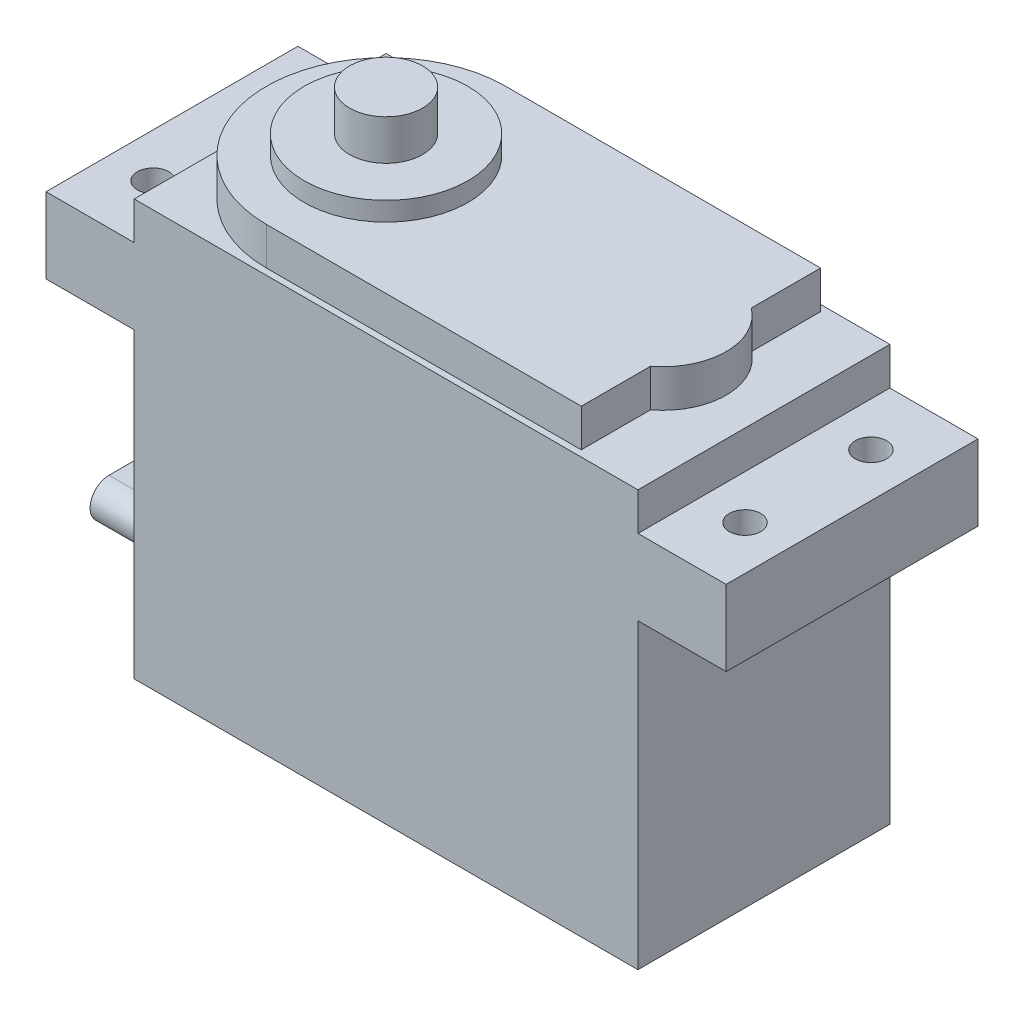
ISO-10303-21;
HEADER;
FILE_DESCRIPTION(('STEP AP214'),'2;1');
FILE_NAME('part.step','',(''),(''),'','','');
FILE_SCHEMA(('AUTOMOTIVE_DESIGN { 1 0 10303 214 1 1 1 1 }'));
ENDSEC;
DATA;
#1=APPLICATION_CONTEXT('core data for automotive mechanical design processes');
#2=APPLICATION_PROTOCOL_DEFINITION('international standard','automotive_design',2000,#1);
#3=PRODUCT_CONTEXT('',#1,'mechanical');
#4=PRODUCT('Part','Part','',(#3));
#5=PRODUCT_RELATED_PRODUCT_CATEGORY('part','',(#4));
#6=PRODUCT_DEFINITION_FORMATION('','',#4);
#7=PRODUCT_DEFINITION_CONTEXT('part definition',#1,'design');
#8=PRODUCT_DEFINITION('design','',#6,#7);
#9=PRODUCT_DEFINITION_SHAPE('','',#8);
#10=(LENGTH_UNIT() NAMED_UNIT(*) SI_UNIT(.MILLI.,.METRE.));
#11=(NAMED_UNIT(*) PLANE_ANGLE_UNIT() SI_UNIT($,.RADIAN.));
#12=(NAMED_UNIT(*) SI_UNIT($,.STERADIAN.) SOLID_ANGLE_UNIT());
#13=UNCERTAINTY_MEASURE_WITH_UNIT(LENGTH_MEASURE(1.E-05),#10,'distance_accuracy_value','');
#14=(GEOMETRIC_REPRESENTATION_CONTEXT(3) GLOBAL_UNCERTAINTY_ASSIGNED_CONTEXT((#13)) GLOBAL_UNIT_ASSIGNED_CONTEXT((#10,
#11,#12)) REPRESENTATION_CONTEXT('',''));
#15=CARTESIAN_POINT('',(0.,0.,0.));
#16=DIRECTION('',(0.,0.,1.));
#17=DIRECTION('',(1.,0.,0.));
#18=AXIS2_PLACEMENT_3D('',#15,#16,#17);
#19=CARTESIAN_POINT('',(-0.5,3.,8.50000000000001));
#20=DIRECTION('',(-1.,0.,0.));
#21=DIRECTION('',(0.,0.,1.));
#22=AXIS2_PLACEMENT_3D('',#19,#20,#21);
#23=PLANE('',#22);
#24=CARTESIAN_POINT('',(-0.5,3.,8.50000000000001));
#25=DIRECTION('',(-1.,0.,0.));
#26=DIRECTION('',(0.,0.,1.));
#27=AXIS2_PLACEMENT_3D('',#24,#25,#26);
#28=CIRCLE('',#27,2.);
#29=CARTESIAN_POINT('',(-0.5,5.,8.50000000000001));
#30=VERTEX_POINT('',#29);
#31=CARTESIAN_POINT('',(-0.5,1.,8.50000000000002));
#32=VERTEX_POINT('',#31);
#33=EDGE_CURVE('E239',#30,#32,#28,.T.);
#34=ORIENTED_EDGE('',*,*,#33,.T.);
#35=DIRECTION('',(0.,0.,1.));
#36=VECTOR('',#35,1.);
#37=CARTESIAN_POINT('',(-0.5,1.,11.5));
#38=LINE('',#37,#36);
#39=CARTESIAN_POINT('',(-0.5,1.,11.5));
#40=VERTEX_POINT('',#39);
#41=EDGE_CURVE('E242',#32,#40,#38,.T.);
#42=ORIENTED_EDGE('',*,*,#41,.T.);
#43=CARTESIAN_POINT('',(-0.5,3.,11.5));
#44=DIRECTION('',(-1.,0.,0.));
#45=DIRECTION('',(0.,0.,-1.));
#46=AXIS2_PLACEMENT_3D('',#43,#44,#45);
#47=CIRCLE('',#46,2.);
#48=CARTESIAN_POINT('',(-0.5,5.,11.5));
#49=VERTEX_POINT('',#48);
#50=EDGE_CURVE('E245',#40,#49,#47,.T.);
#51=ORIENTED_EDGE('',*,*,#50,.T.);
#52=DIRECTION('',(0.,0.,-1.));
#53=VECTOR('',#52,1.);
#54=CARTESIAN_POINT('',(-0.5,5.,8.50000000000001));
#55=LINE('',#54,#53);
#56=EDGE_CURVE('E247',#49,#30,#55,.T.);
#57=ORIENTED_EDGE('',*,*,#56,.T.);
#58=EDGE_LOOP('',(#34,#42,#51,#57));
#59=FACE_BOUND('',#58,.T.);
#60=DIRECTION('',(0.,0.,1.));
#61=VECTOR('',#60,1.);
#62=CARTESIAN_POINT('',(-0.5,1.5,8.50000000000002));
#63=LINE('',#62,#61);
#64=CARTESIAN_POINT('',(-0.5,1.5,8.50000000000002));
#65=VERTEX_POINT('',#64);
#66=CARTESIAN_POINT('',(-0.5,1.5,11.5));
#67=VERTEX_POINT('',#66);
#68=EDGE_CURVE('E852',#65,#67,#63,.T.);
#69=ORIENTED_EDGE('',*,*,#68,.F.);
#70=CARTESIAN_POINT('',(-0.5,3.,8.50000000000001));
#71=DIRECTION('',(-1.,0.,0.));
#72=DIRECTION('',(0.,0.,1.));
#73=AXIS2_PLACEMENT_3D('',#70,#71,#72);
#74=CIRCLE('',#73,1.5);
#75=CARTESIAN_POINT('',(-0.5,4.5,8.50000000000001));
#76=VERTEX_POINT('',#75);
#77=EDGE_CURVE('E230',#76,#65,#74,.T.);
#78=ORIENTED_EDGE('',*,*,#77,.F.);
#79=DIRECTION('',(0.,0.,-1.));
#80=VECTOR('',#79,1.);
#81=CARTESIAN_POINT('',(-0.5,4.5,11.5));
#82=LINE('',#81,#80);
#83=CARTESIAN_POINT('',(-0.5,4.5,11.5));
#84=VERTEX_POINT('',#83);
#85=EDGE_CURVE('E226',#84,#76,#82,.T.);
#86=ORIENTED_EDGE('',*,*,#85,.F.);
#87=CARTESIAN_POINT('',(-0.5,3.,11.5));
#88=DIRECTION('',(-1.,0.,0.));
#89=DIRECTION('',(0.,0.,1.));
#90=AXIS2_PLACEMENT_3D('',#87,#88,#89);
#91=CIRCLE('',#90,1.5);
#92=EDGE_CURVE('E849',#67,#84,#91,.T.);
#93=ORIENTED_EDGE('',*,*,#92,.F.);
#94=EDGE_LOOP('',(#69,#78,#86,#93));
#95=FACE_BOUND('',#94,.T.);
#96=ADVANCED_FACE('F34',(#59,#95),#23,.T.);
#97=CARTESIAN_POINT('',(0.,0.,20.));
#98=DIRECTION('',(1.,0.,0.));
#99=DIRECTION('',(0.,0.,-1.));
#100=AXIS2_PLACEMENT_3D('',#97,#98,#99);
#101=PLANE('',#100);
#102=DIRECTION('',(0.,-1.,0.));
#103=VECTOR('',#102,1.);
#104=CARTESIAN_POINT('',(0.,0.,0.));
#105=LINE('',#104,#103);
#106=CARTESIAN_POINT('',(0.,24.,0.));
#107=VERTEX_POINT('',#106);
#108=CARTESIAN_POINT('',(0.,0.,0.));
#109=VERTEX_POINT('',#108);
#110=EDGE_CURVE('E371',#107,#109,#105,.T.);
#111=ORIENTED_EDGE('',*,*,#110,.T.);
#112=DIRECTION('',(0.,0.,-1.));
#113=VECTOR('',#112,1.);
#114=CARTESIAN_POINT('',(0.,0.,20.));
#115=LINE('',#114,#113);
#116=CARTESIAN_POINT('',(0.,0.,20.));
#117=VERTEX_POINT('',#116);
#118=EDGE_CURVE('E42',#117,#109,#115,.T.);
#119=ORIENTED_EDGE('',*,*,#118,.F.);
#120=DIRECTION('',(0.,-1.,0.));
#121=VECTOR('',#120,1.);
#122=CARTESIAN_POINT('',(0.,0.,20.));
#123=LINE('',#122,#121);
#124=CARTESIAN_POINT('',(0.,24.,20.));
#125=VERTEX_POINT('',#124);
#126=EDGE_CURVE('E344',#125,#117,#123,.T.);
#127=ORIENTED_EDGE('',*,*,#126,.F.);
#128=DIRECTION('',(0.,0.,-1.));
#129=VECTOR('',#128,1.);
#130=CARTESIAN_POINT('',(0.,24.,20.));
#131=LINE('',#130,#129);
#132=EDGE_CURVE('E370',#125,#107,#131,.T.);
#133=ORIENTED_EDGE('',*,*,#132,.T.);
#134=EDGE_LOOP('',(#111,#119,#127,#133));
#135=FACE_BOUND('',#134,.T.);
#136=CARTESIAN_POINT('',(0.,3.,8.50000000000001));
#137=DIRECTION('',(-1.,0.,0.));
#138=DIRECTION('',(0.,0.,1.));
#139=AXIS2_PLACEMENT_3D('',#136,#137,#138);
#140=CIRCLE('',#139,2.);
#141=CARTESIAN_POINT('',(0.,5.,8.50000000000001));
#142=VERTEX_POINT('',#141);
#143=CARTESIAN_POINT('',(0.,1.,8.50000000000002));
#144=VERTEX_POINT('',#143);
#145=EDGE_CURVE('E232',#142,#144,#140,.T.);
#146=ORIENTED_EDGE('',*,*,#145,.F.);
#147=DIRECTION('',(0.,0.,-1.));
#148=VECTOR('',#147,1.);
#149=CARTESIAN_POINT('',(0.,5.,8.50000000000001));
#150=LINE('',#149,#148);
#151=CARTESIAN_POINT('',(0.,5.,11.5));
#152=VERTEX_POINT('',#151);
#153=EDGE_CURVE('E243',#152,#142,#150,.T.);
#154=ORIENTED_EDGE('',*,*,#153,.F.);
#155=CARTESIAN_POINT('',(0.,3.,11.5));
#156=DIRECTION('',(-1.,0.,0.));
#157=DIRECTION('',(0.,0.,-1.));
#158=AXIS2_PLACEMENT_3D('',#155,#156,#157);
#159=CIRCLE('',#158,2.);
#160=CARTESIAN_POINT('',(0.,1.,11.5));
#161=VERTEX_POINT('',#160);
#162=EDGE_CURVE('E251',#161,#152,#159,.T.);
#163=ORIENTED_EDGE('',*,*,#162,.F.);
#164=DIRECTION('',(0.,0.,1.));
#165=VECTOR('',#164,1.);
#166=CARTESIAN_POINT('',(0.,1.,11.5));
#167=LINE('',#166,#165);
#168=EDGE_CURVE('E57',#144,#161,#167,.T.);
#169=ORIENTED_EDGE('',*,*,#168,.F.);
#170=EDGE_LOOP('',(#146,#154,#163,#169));
#171=FACE_BOUND('',#170,.T.);
#172=ADVANCED_FACE('F36',(#135,#171),#101,.F.);
#173=CARTESIAN_POINT('',(10.,37.5,10.));
#174=DIRECTION('',(0.,1.,0.));
#175=DIRECTION('',(0.,0.,1.));
#176=AXIS2_PLACEMENT_3D('',#173,#174,#175);
#177=PLANE('',#176);
#178=CARTESIAN_POINT('',(10.,37.5,10.));
#179=DIRECTION('',(0.,1.,0.));
#180=DIRECTION('',(0.,0.,1.));
#181=AXIS2_PLACEMENT_3D('',#178,#179,#180);
#182=CIRCLE('',#181,6.5);
#183=CARTESIAN_POINT('',(10.,37.5,16.5));
#184=VERTEX_POINT('',#183);
#185=EDGE_CURVE('E270',#184,#184,#182,.T.);
#186=ORIENTED_EDGE('',*,*,#185,.T.);
#187=EDGE_LOOP('',(#186));
#188=FACE_BOUND('',#187,.T.);
#189=CARTESIAN_POINT('',(10.,37.5,10.));
#190=DIRECTION('',(0.,1.,0.));
#191=DIRECTION('',(0.,0.,1.));
#192=AXIS2_PLACEMENT_3D('',#189,#190,#191);
#193=CIRCLE('',#192,2.9);
#194=CARTESIAN_POINT('',(10.,37.5,12.9));
#195=VERTEX_POINT('',#194);
#196=EDGE_CURVE('E266',#195,#195,#193,.T.);
#197=ORIENTED_EDGE('',*,*,#196,.F.);
#198=EDGE_LOOP('',(#197));
#199=FACE_BOUND('',#198,.T.);
#200=ADVANCED_FACE('F458',(#188,#199),#177,.T.);
#201=CARTESIAN_POINT('',(32.,36.,10.));
#202=DIRECTION('',(0.,-1.,0.));
#203=DIRECTION('',(0.,0.,-1.));
#204=AXIS2_PLACEMENT_3D('',#201,#202,#203);
#205=PLANE('',#204);
#206=DIRECTION('',(0.,0.,-1.));
#207=VECTOR('',#206,1.);
#208=CARTESIAN_POINT('',(35.,36.,0.5));
#209=LINE('',#208,#207);
#210=CARTESIAN_POINT('',(35.,36.,6.));
#211=VERTEX_POINT('',#210);
#212=CARTESIAN_POINT('',(35.,36.,0.5));
#213=VERTEX_POINT('',#212);
#214=EDGE_CURVE('E276',#211,#213,#209,.T.);
#215=ORIENTED_EDGE('',*,*,#214,.T.);
#216=DIRECTION('',(-1.,0.,0.));
#217=VECTOR('',#216,1.);
#218=CARTESIAN_POINT('',(10.,36.,0.5));
#219=LINE('',#218,#217);
#220=CARTESIAN_POINT('',(10.,36.,0.5));
#221=VERTEX_POINT('',#220);
#222=EDGE_CURVE('E279',#213,#221,#219,.T.);
#223=ORIENTED_EDGE('',*,*,#222,.T.);
#224=CARTESIAN_POINT('',(10.,36.,10.));
#225=DIRECTION('',(0.,1.,0.));
#226=DIRECTION('',(0.,0.,1.));
#227=AXIS2_PLACEMENT_3D('',#224,#225,#226);
#228=CIRCLE('',#227,9.5);
#229=CARTESIAN_POINT('',(10.,36.,19.5));
#230=VERTEX_POINT('',#229);
#231=EDGE_CURVE('E282',#221,#230,#228,.T.);
#232=ORIENTED_EDGE('',*,*,#231,.T.);
#233=DIRECTION('',(1.,0.,0.));
#234=VECTOR('',#233,1.);
#235=CARTESIAN_POINT('',(35.,36.,19.5));
#236=LINE('',#235,#234);
#237=CARTESIAN_POINT('',(35.,36.,19.5));
#238=VERTEX_POINT('',#237);
#239=EDGE_CURVE('E284',#230,#238,#236,.T.);
#240=ORIENTED_EDGE('',*,*,#239,.T.);
#241=DIRECTION('',(0.,0.,-1.));
#242=VECTOR('',#241,1.);
#243=CARTESIAN_POINT('',(35.,36.,14.));
#244=LINE('',#243,#242);
#245=CARTESIAN_POINT('',(35.,36.,14.));
#246=VERTEX_POINT('',#245);
#247=EDGE_CURVE('E286',#238,#246,#244,.T.);
#248=ORIENTED_EDGE('',*,*,#247,.T.);
#249=CARTESIAN_POINT('',(32.,36.,10.));
#250=DIRECTION('',(0.,1.,0.));
#251=DIRECTION('',(0.,0.,-1.));
#252=AXIS2_PLACEMENT_3D('',#249,#250,#251);
#253=CIRCLE('',#252,5.);
#254=EDGE_CURVE('E288',#246,#211,#253,.T.);
#255=ORIENTED_EDGE('',*,*,#254,.T.);
#256=EDGE_LOOP('',(#215,#223,#232,#240,#248,#255));
#257=FACE_BOUND('',#256,.T.);
#258=CARTESIAN_POINT('',(10.,36.,10.));
#259=DIRECTION('',(0.,-1.,0.));
#260=DIRECTION('',(0.,0.,-1.));
#261=AXIS2_PLACEMENT_3D('',#258,#259,#260);
#262=CIRCLE('',#261,6.5);
#263=CARTESIAN_POINT('',(10.,36.,3.5));
#264=VERTEX_POINT('',#263);
#265=EDGE_CURVE('E11',#264,#264,#262,.F.);
#266=ORIENTED_EDGE('',*,*,#265,.F.);
#267=EDGE_LOOP('',(#266));
#268=FACE_BOUND('',#267,.T.);
#269=ADVANCED_FACE('F491',(#257,#268),#205,.F.);
#270=CARTESIAN_POINT('',(0.,33.,20.));
#271=DIRECTION('',(0.,-1.,0.));
#272=DIRECTION('',(0.,0.,-1.));
#273=AXIS2_PLACEMENT_3D('',#270,#271,#272);
#274=PLANE('',#273);
#275=DIRECTION('',(-1.,0.,0.));
#276=VECTOR('',#275,1.);
#277=CARTESIAN_POINT('',(0.,33.,0.));
#278=LINE('',#277,#276);
#279=CARTESIAN_POINT('',(40.,33.,0.));
#280=VERTEX_POINT('',#279);
#281=CARTESIAN_POINT('',(0.,33.,0.));
#282=VERTEX_POINT('',#281);
#283=EDGE_CURVE('E386',#280,#282,#278,.T.);
#284=ORIENTED_EDGE('',*,*,#283,.T.);
#285=DIRECTION('',(0.,0.,-1.));
#286=VECTOR('',#285,1.);
#287=CARTESIAN_POINT('',(0.,33.,20.));
#288=LINE('',#287,#286);
#289=CARTESIAN_POINT('',(0.,33.,20.));
#290=VERTEX_POINT('',#289);
#291=EDGE_CURVE('E406',#290,#282,#288,.T.);
#292=ORIENTED_EDGE('',*,*,#291,.F.);
#293=DIRECTION('',(-1.,0.,0.));
#294=VECTOR('',#293,1.);
#295=CARTESIAN_POINT('',(0.,33.,20.));
#296=LINE('',#295,#294);
#297=CARTESIAN_POINT('',(40.,33.,20.));
#298=VERTEX_POINT('',#297);
#299=EDGE_CURVE('E360',#298,#290,#296,.T.);
#300=ORIENTED_EDGE('',*,*,#299,.F.);
#301=DIRECTION('',(0.,0.,-1.));
#302=VECTOR('',#301,1.);
#303=CARTESIAN_POINT('',(40.,33.,20.));
#304=LINE('',#303,#302);
#305=EDGE_CURVE('E409',#298,#280,#304,.T.);
#306=ORIENTED_EDGE('',*,*,#305,.T.);
#307=EDGE_LOOP('',(#284,#292,#300,#306));
#308=FACE_BOUND('',#307,.T.);
#309=DIRECTION('',(0.,0.,-1.));
#310=VECTOR('',#309,1.);
#311=CARTESIAN_POINT('',(35.,33.,0.5));
#312=LINE('',#311,#310);
#313=CARTESIAN_POINT('',(35.,33.,6.));
#314=VERTEX_POINT('',#313);
#315=CARTESIAN_POINT('',(35.,33.,0.5));
#316=VERTEX_POINT('',#315);
#317=EDGE_CURVE('E275',#314,#316,#312,.T.);
#318=ORIENTED_EDGE('',*,*,#317,.F.);
#319=CARTESIAN_POINT('',(32.,33.,10.));
#320=DIRECTION('',(0.,1.,0.));
#321=DIRECTION('',(0.,0.,-1.));
#322=AXIS2_PLACEMENT_3D('',#319,#320,#321);
#323=CIRCLE('',#322,5.);
#324=CARTESIAN_POINT('',(35.,33.,14.));
#325=VERTEX_POINT('',#324);
#326=EDGE_CURVE('E280',#325,#314,#323,.T.);
#327=ORIENTED_EDGE('',*,*,#326,.F.);
#328=DIRECTION('',(0.,0.,-1.));
#329=VECTOR('',#328,1.);
#330=CARTESIAN_POINT('',(35.,33.,14.));
#331=LINE('',#330,#329);
#332=CARTESIAN_POINT('',(35.,33.,19.5));
#333=VERTEX_POINT('',#332);
#334=EDGE_CURVE('E302',#333,#325,#331,.T.);
#335=ORIENTED_EDGE('',*,*,#334,.F.);
#336=DIRECTION('',(1.,0.,0.));
#337=VECTOR('',#336,1.);
#338=CARTESIAN_POINT('',(35.,33.,19.5));
#339=LINE('',#338,#337);
#340=CARTESIAN_POINT('',(10.,33.,19.5));
#341=VERTEX_POINT('',#340);
#342=EDGE_CURVE('E299',#341,#333,#339,.T.);
#343=ORIENTED_EDGE('',*,*,#342,.F.);
#344=CARTESIAN_POINT('',(10.,33.,10.));
#345=DIRECTION('',(0.,1.,0.));
#346=DIRECTION('',(0.,0.,1.));
#347=AXIS2_PLACEMENT_3D('',#344,#345,#346);
#348=CIRCLE('',#347,9.5);
#349=CARTESIAN_POINT('',(10.,33.,0.5));
#350=VERTEX_POINT('',#349);
#351=EDGE_CURVE('E296',#350,#341,#348,.T.);
#352=ORIENTED_EDGE('',*,*,#351,.F.);
#353=DIRECTION('',(-1.,0.,0.));
#354=VECTOR('',#353,1.);
#355=CARTESIAN_POINT('',(10.,33.,0.5));
#356=LINE('',#355,#354);
#357=EDGE_CURVE('E293',#316,#350,#356,.T.);
#358=ORIENTED_EDGE('',*,*,#357,.F.);
#359=EDGE_LOOP('',(#318,#327,#335,#343,#352,#358));
#360=FACE_BOUND('',#359,.T.);
#361=ADVANCED_FACE('F499',(#308,#360),#274,.F.);
#362=CARTESIAN_POINT('',(0.,0.,20.));
#363=DIRECTION('',(0.,1.,0.));
#364=DIRECTION('',(0.,0.,1.));
#365=AXIS2_PLACEMENT_3D('',#362,#363,#364);
#366=PLANE('',#365);
#367=DIRECTION('',(1.,0.,0.));
#368=VECTOR('',#367,1.);
#369=CARTESIAN_POINT('',(0.,0.,0.));
#370=LINE('',#369,#368);
#371=CARTESIAN_POINT('',(40.,0.,0.));
#372=VERTEX_POINT('',#371);
#373=EDGE_CURVE('E374',#109,#372,#370,.T.);
#374=ORIENTED_EDGE('',*,*,#373,.T.);
#375=DIRECTION('',(0.,0.,-1.));
#376=VECTOR('',#375,1.);
#377=CARTESIAN_POINT('',(40.,0.,20.));
#378=LINE('',#377,#376);
#379=CARTESIAN_POINT('',(40.,0.,20.));
#380=VERTEX_POINT('',#379);
#381=EDGE_CURVE('E424',#380,#372,#378,.T.);
#382=ORIENTED_EDGE('',*,*,#381,.F.);
#383=DIRECTION('',(1.,0.,0.));
#384=VECTOR('',#383,1.);
#385=CARTESIAN_POINT('',(0.,0.,20.));
#386=LINE('',#385,#384);
#387=EDGE_CURVE('E347',#117,#380,#386,.T.);
#388=ORIENTED_EDGE('',*,*,#387,.F.);
#389=ORIENTED_EDGE('',*,*,#118,.T.);
#390=EDGE_LOOP('',(#374,#382,#388,#389));
#391=FACE_BOUND('',#390,.T.);
#392=ADVANCED_FACE('F572',(#391),#366,.F.);
#393=CARTESIAN_POINT('',(40.,0.,20.));
#394=DIRECTION('',(-1.,0.,0.));
#395=DIRECTION('',(0.,0.,1.));
#396=AXIS2_PLACEMENT_3D('',#393,#394,#395);
#397=PLANE('',#396);
#398=DIRECTION('',(0.,1.,0.));
#399=VECTOR('',#398,1.);
#400=CARTESIAN_POINT('',(40.,0.,0.));
#401=LINE('',#400,#399);
#402=CARTESIAN_POINT('',(40.,24.,0.));
#403=VERTEX_POINT('',#402);
#404=EDGE_CURVE('E376',#372,#403,#401,.T.);
#405=ORIENTED_EDGE('',*,*,#404,.T.);
#406=DIRECTION('',(0.,0.,-1.));
#407=VECTOR('',#406,1.);
#408=CARTESIAN_POINT('',(40.,24.,20.));
#409=LINE('',#408,#407);
#410=CARTESIAN_POINT('',(40.,24.,20.));
#411=VERTEX_POINT('',#410);
#412=EDGE_CURVE('E421',#411,#403,#409,.T.);
#413=ORIENTED_EDGE('',*,*,#412,.F.);
#414=DIRECTION('',(0.,1.,0.));
#415=VECTOR('',#414,1.);
#416=CARTESIAN_POINT('',(40.,0.,20.));
#417=LINE('',#416,#415);
#418=EDGE_CURVE('E350',#380,#411,#417,.T.);
#419=ORIENTED_EDGE('',*,*,#418,.F.);
#420=ORIENTED_EDGE('',*,*,#381,.T.);
#421=EDGE_LOOP('',(#405,#413,#419,#420));
#422=FACE_BOUND('',#421,.T.);
#423=ADVANCED_FACE('F536',(#422),#397,.F.);
#424=CARTESIAN_POINT('',(40.,24.,20.));
#425=DIRECTION('',(0.,1.,0.));
#426=DIRECTION('',(0.,0.,1.));
#427=AXIS2_PLACEMENT_3D('',#424,#425,#426);
#428=PLANE('',#427);
#429=CARTESIAN_POINT('',(43.5,24.,5.));
#430=DIRECTION('',(0.,1.,0.));
#431=DIRECTION('',(0.,0.,1.));
#432=AXIS2_PLACEMENT_3D('',#429,#430,#431);
#433=CIRCLE('',#432,1.25);
#434=CARTESIAN_POINT('',(43.5,24.,6.25));
#435=VERTEX_POINT('',#434);
#436=EDGE_CURVE('E327',#435,#435,#433,.T.);
#437=ORIENTED_EDGE('',*,*,#436,.T.);
#438=EDGE_LOOP('',(#437));
#439=FACE_BOUND('',#438,.T.);
#440=CARTESIAN_POINT('',(43.5,24.,15.));
#441=DIRECTION('',(0.,1.,0.));
#442=DIRECTION('',(0.,0.,1.));
#443=AXIS2_PLACEMENT_3D('',#440,#441,#442);
#444=CIRCLE('',#443,1.25);
#445=CARTESIAN_POINT('',(43.5,24.,16.25));
#446=VERTEX_POINT('',#445);
#447=EDGE_CURVE('E333',#446,#446,#444,.T.);
#448=ORIENTED_EDGE('',*,*,#447,.T.);
#449=EDGE_LOOP('',(#448));
#450=FACE_BOUND('',#449,.T.);
#451=DIRECTION('',(1.,0.,0.));
#452=VECTOR('',#451,1.);
#453=CARTESIAN_POINT('',(40.,24.,0.));
#454=LINE('',#453,#452);
#455=CARTESIAN_POINT('',(47.,24.,0.));
#456=VERTEX_POINT('',#455);
#457=EDGE_CURVE('E378',#403,#456,#454,.T.);
#458=ORIENTED_EDGE('',*,*,#457,.T.);
#459=DIRECTION('',(0.,0.,-1.));
#460=VECTOR('',#459,1.);
#461=CARTESIAN_POINT('',(47.,24.,20.));
#462=LINE('',#461,#460);
#463=CARTESIAN_POINT('',(47.,24.,20.));
#464=VERTEX_POINT('',#463);
#465=EDGE_CURVE('E418',#464,#456,#462,.T.);
#466=ORIENTED_EDGE('',*,*,#465,.F.);
#467=DIRECTION('',(1.,0.,0.));
#468=VECTOR('',#467,1.);
#469=CARTESIAN_POINT('',(40.,24.,20.));
#470=LINE('',#469,#468);
#471=EDGE_CURVE('E352',#411,#464,#470,.T.);
#472=ORIENTED_EDGE('',*,*,#471,.F.);
#473=ORIENTED_EDGE('',*,*,#412,.T.);
#474=EDGE_LOOP('',(#458,#466,#472,#473));
#475=FACE_BOUND('',#474,.T.);
#476=ADVANCED_FACE('F532',(#439,#450,#475),#428,.F.);
#477=CARTESIAN_POINT('',(47.,24.,20.));
#478=DIRECTION('',(-1.,0.,0.));
#479=DIRECTION('',(0.,0.,1.));
#480=AXIS2_PLACEMENT_3D('',#477,#478,#479);
#481=PLANE('',#480);
#482=DIRECTION('',(0.,1.,0.));
#483=VECTOR('',#482,1.);
#484=CARTESIAN_POINT('',(47.,24.,0.));
#485=LINE('',#484,#483);
#486=CARTESIAN_POINT('',(47.,30.,0.));
#487=VERTEX_POINT('',#486);
#488=EDGE_CURVE('E380',#456,#487,#485,.T.);
#489=ORIENTED_EDGE('',*,*,#488,.T.);
#490=DIRECTION('',(0.,0.,-1.));
#491=VECTOR('',#490,1.);
#492=CARTESIAN_POINT('',(47.,30.,20.));
#493=LINE('',#492,#491);
#494=CARTESIAN_POINT('',(47.,30.,20.));
#495=VERTEX_POINT('',#494);
#496=EDGE_CURVE('E415',#495,#487,#493,.T.);
#497=ORIENTED_EDGE('',*,*,#496,.F.);
#498=DIRECTION('',(0.,1.,0.));
#499=VECTOR('',#498,1.);
#500=CARTESIAN_POINT('',(47.,24.,20.));
#501=LINE('',#500,#499);
#502=EDGE_CURVE('E354',#464,#495,#501,.T.);
#503=ORIENTED_EDGE('',*,*,#502,.F.);
#504=ORIENTED_EDGE('',*,*,#465,.T.);
#505=EDGE_LOOP('',(#489,#497,#503,#504));
#506=FACE_BOUND('',#505,.T.);
#507=ADVANCED_FACE('F535',(#506),#481,.F.);
#508=CARTESIAN_POINT('',(47.,30.,20.));
#509=DIRECTION('',(0.,-1.,0.));
#510=DIRECTION('',(1.,0.,0.));
#511=AXIS2_PLACEMENT_3D('',#508,#509,#510);
#512=PLANE('',#511);
#513=CARTESIAN_POINT('',(43.5,30.,5.));
#514=DIRECTION('',(0.,1.,0.));
#515=DIRECTION('',(0.,0.,1.));
#516=AXIS2_PLACEMENT_3D('',#513,#514,#515);
#517=CIRCLE('',#516,1.25);
#518=CARTESIAN_POINT('',(43.5,30.,6.25));
#519=VERTEX_POINT('',#518);
#520=EDGE_CURVE('E324',#519,#519,#517,.T.);
#521=ORIENTED_EDGE('',*,*,#520,.F.);
#522=EDGE_LOOP('',(#521));
#523=FACE_BOUND('',#522,.T.);
#524=CARTESIAN_POINT('',(43.5,30.,15.));
#525=DIRECTION('',(0.,1.,0.));
#526=DIRECTION('',(0.,0.,1.));
#527=AXIS2_PLACEMENT_3D('',#524,#525,#526);
#528=CIRCLE('',#527,1.25);
#529=CARTESIAN_POINT('',(43.5,30.,16.25));
#530=VERTEX_POINT('',#529);
#531=EDGE_CURVE('E330',#530,#530,#528,.T.);
#532=ORIENTED_EDGE('',*,*,#531,.F.);
#533=EDGE_LOOP('',(#532));
#534=FACE_BOUND('',#533,.T.);
#535=DIRECTION('',(-1.,0.,0.));
#536=VECTOR('',#535,1.);
#537=CARTESIAN_POINT('',(47.,30.,0.));
#538=LINE('',#537,#536);
#539=CARTESIAN_POINT('',(40.,30.,0.));
#540=VERTEX_POINT('',#539);
#541=EDGE_CURVE('E382',#487,#540,#538,.T.);
#542=ORIENTED_EDGE('',*,*,#541,.T.);
#543=DIRECTION('',(0.,0.,-1.));
#544=VECTOR('',#543,1.);
#545=CARTESIAN_POINT('',(40.,30.,20.));
#546=LINE('',#545,#544);
#547=CARTESIAN_POINT('',(40.,30.,20.));
#548=VERTEX_POINT('',#547);
#549=EDGE_CURVE('E412',#548,#540,#546,.T.);
#550=ORIENTED_EDGE('',*,*,#549,.F.);
#551=DIRECTION('',(-1.,0.,0.));
#552=VECTOR('',#551,1.);
#553=CARTESIAN_POINT('',(47.,30.,20.));
#554=LINE('',#553,#552);
#555=EDGE_CURVE('E356',#495,#548,#554,.T.);
#556=ORIENTED_EDGE('',*,*,#555,.F.);
#557=ORIENTED_EDGE('',*,*,#496,.T.);
#558=EDGE_LOOP('',(#542,#550,#556,#557));
#559=FACE_BOUND('',#558,.T.);
#560=ADVANCED_FACE('F556',(#523,#534,#559),#512,.F.);
#561=CARTESIAN_POINT('',(40.,30.,20.));
#562=DIRECTION('',(-1.,0.,0.));
#563=DIRECTION('',(0.,0.,1.));
#564=AXIS2_PLACEMENT_3D('',#561,#562,#563);
#565=PLANE('',#564);
#566=DIRECTION('',(0.,1.,0.));
#567=VECTOR('',#566,1.);
#568=CARTESIAN_POINT('',(40.,30.,0.));
#569=LINE('',#568,#567);
#570=EDGE_CURVE('E384',#540,#280,#569,.T.);
#571=ORIENTED_EDGE('',*,*,#570,.T.);
#572=ORIENTED_EDGE('',*,*,#305,.F.);
#573=DIRECTION('',(0.,1.,0.));
#574=VECTOR('',#573,1.);
#575=CARTESIAN_POINT('',(40.,30.,20.));
#576=LINE('',#575,#574);
#577=EDGE_CURVE('E358',#548,#298,#576,.T.);
#578=ORIENTED_EDGE('',*,*,#577,.F.);
#579=ORIENTED_EDGE('',*,*,#549,.T.);
#580=EDGE_LOOP('',(#571,#572,#578,#579));
#581=FACE_BOUND('',#580,.T.);
#582=ADVANCED_FACE('F560',(#581),#565,.F.);
#583=CARTESIAN_POINT('',(0.,30.,20.));
#584=DIRECTION('',(1.,0.,0.));
#585=DIRECTION('',(0.,0.,-1.));
#586=AXIS2_PLACEMENT_3D('',#583,#584,#585);
#587=PLANE('',#586);
#588=DIRECTION('',(0.,-1.,0.));
#589=VECTOR('',#588,1.);
#590=CARTESIAN_POINT('',(0.,30.,0.));
#591=LINE('',#590,#589);
#592=CARTESIAN_POINT('',(0.,30.,0.));
#593=VERTEX_POINT('',#592);
#594=EDGE_CURVE('E388',#282,#593,#591,.T.);
#595=ORIENTED_EDGE('',*,*,#594,.T.);
#596=DIRECTION('',(0.,0.,-1.));
#597=VECTOR('',#596,1.);
#598=CARTESIAN_POINT('',(0.,30.,20.));
#599=LINE('',#598,#597);
#600=CARTESIAN_POINT('',(0.,30.,20.));
#601=VERTEX_POINT('',#600);
#602=EDGE_CURVE('E403',#601,#593,#599,.T.);
#603=ORIENTED_EDGE('',*,*,#602,.F.);
#604=DIRECTION('',(0.,-1.,0.));
#605=VECTOR('',#604,1.);
#606=CARTESIAN_POINT('',(0.,30.,20.));
#607=LINE('',#606,#605);
#608=EDGE_CURVE('E362',#290,#601,#607,.T.);
#609=ORIENTED_EDGE('',*,*,#608,.F.);
#610=ORIENTED_EDGE('',*,*,#291,.T.);
#611=EDGE_LOOP('',(#595,#603,#609,#610));
#612=FACE_BOUND('',#611,.T.);
#613=ADVANCED_FACE('F591',(#612),#587,.F.);
#614=CARTESIAN_POINT('',(0.,30.,20.));
#615=DIRECTION('',(0.,-1.,0.));
#616=DIRECTION('',(0.,0.,-1.));
#617=AXIS2_PLACEMENT_3D('',#614,#615,#616);
#618=PLANE('',#617);
#619=CARTESIAN_POINT('',(-3.5,30.,15.));
#620=DIRECTION('',(0.,1.,0.));
#621=DIRECTION('',(0.,0.,1.));
#622=AXIS2_PLACEMENT_3D('',#619,#620,#621);
#623=CIRCLE('',#622,1.25);
#624=CARTESIAN_POINT('',(-3.5,30.,16.25));
#625=VERTEX_POINT('',#624);
#626=EDGE_CURVE('E336',#625,#625,#623,.T.);
#627=ORIENTED_EDGE('',*,*,#626,.F.);
#628=EDGE_LOOP('',(#627));
#629=FACE_BOUND('',#628,.T.);
#630=CARTESIAN_POINT('',(-3.5,30.,5.));
#631=DIRECTION('',(0.,1.,0.));
#632=DIRECTION('',(0.,0.,1.));
#633=AXIS2_PLACEMENT_3D('',#630,#631,#632);
#634=CIRCLE('',#633,1.25);
#635=CARTESIAN_POINT('',(-3.5,30.,6.25));
#636=VERTEX_POINT('',#635);
#637=EDGE_CURVE('E340',#636,#636,#634,.T.);
#638=ORIENTED_EDGE('',*,*,#637,.F.);
#639=EDGE_LOOP('',(#638));
#640=FACE_BOUND('',#639,.T.);
#641=DIRECTION('',(-1.,0.,0.));
#642=VECTOR('',#641,1.);
#643=CARTESIAN_POINT('',(0.,30.,0.));
#644=LINE('',#643,#642);
#645=CARTESIAN_POINT('',(-7.,30.,0.));
#646=VERTEX_POINT('',#645);
#647=EDGE_CURVE('E390',#593,#646,#644,.T.);
#648=ORIENTED_EDGE('',*,*,#647,.T.);
#649=DIRECTION('',(0.,0.,-1.));
#650=VECTOR('',#649,1.);
#651=CARTESIAN_POINT('',(-7.,30.,20.));
#652=LINE('',#651,#650);
#653=CARTESIAN_POINT('',(-7.,30.,20.));
#654=VERTEX_POINT('',#653);
#655=EDGE_CURVE('E400',#654,#646,#652,.T.);
#656=ORIENTED_EDGE('',*,*,#655,.F.);
#657=DIRECTION('',(-1.,0.,0.));
#658=VECTOR('',#657,1.);
#659=CARTESIAN_POINT('',(0.,30.,20.));
#660=LINE('',#659,#658);
#661=EDGE_CURVE('E364',#601,#654,#660,.T.);
#662=ORIENTED_EDGE('',*,*,#661,.F.);
#663=ORIENTED_EDGE('',*,*,#602,.T.);
#664=EDGE_LOOP('',(#648,#656,#662,#663));
#665=FACE_BOUND('',#664,.T.);
#666=ADVANCED_FACE('F587',(#629,#640,#665),#618,.F.);
#667=CARTESIAN_POINT('',(-7.,24.,20.));
#668=DIRECTION('',(1.,0.,0.));
#669=DIRECTION('',(0.,0.,-1.));
#670=AXIS2_PLACEMENT_3D('',#667,#668,#669);
#671=PLANE('',#670);
#672=DIRECTION('',(0.,-1.,0.));
#673=VECTOR('',#672,1.);
#674=CARTESIAN_POINT('',(-7.,24.,0.));
#675=LINE('',#674,#673);
#676=CARTESIAN_POINT('',(-7.,24.,0.));
#677=VERTEX_POINT('',#676);
#678=EDGE_CURVE('E392',#646,#677,#675,.T.);
#679=ORIENTED_EDGE('',*,*,#678,.T.);
#680=DIRECTION('',(0.,0.,-1.));
#681=VECTOR('',#680,1.);
#682=CARTESIAN_POINT('',(-7.,24.,20.));
#683=LINE('',#682,#681);
#684=CARTESIAN_POINT('',(-7.,24.,20.));
#685=VERTEX_POINT('',#684);
#686=EDGE_CURVE('E397',#685,#677,#683,.T.);
#687=ORIENTED_EDGE('',*,*,#686,.F.);
#688=DIRECTION('',(0.,-1.,0.));
#689=VECTOR('',#688,1.);
#690=CARTESIAN_POINT('',(-7.,24.,20.));
#691=LINE('',#690,#689);
#692=EDGE_CURVE('E366',#654,#685,#691,.T.);
#693=ORIENTED_EDGE('',*,*,#692,.F.);
#694=ORIENTED_EDGE('',*,*,#655,.T.);
#695=EDGE_LOOP('',(#679,#687,#693,#694));
#696=FACE_BOUND('',#695,.T.);
#697=ADVANCED_FACE('F582',(#696),#671,.F.);
#698=CARTESIAN_POINT('',(-7.,24.,20.));
#699=DIRECTION('',(0.,1.,0.));
#700=DIRECTION('',(0.,0.,1.));
#701=AXIS2_PLACEMENT_3D('',#698,#699,#700);
#702=PLANE('',#701);
#703=CARTESIAN_POINT('',(-3.5,24.,15.));
#704=DIRECTION('',(0.,1.,0.));
#705=DIRECTION('',(0.,0.,1.));
#706=AXIS2_PLACEMENT_3D('',#703,#704,#705);
#707=CIRCLE('',#706,1.25);
#708=CARTESIAN_POINT('',(-3.5,24.,16.25));
#709=VERTEX_POINT('',#708);
#710=EDGE_CURVE('E339',#709,#709,#707,.T.);
#711=ORIENTED_EDGE('',*,*,#710,.T.);
#712=EDGE_LOOP('',(#711));
#713=FACE_BOUND('',#712,.T.);
#714=CARTESIAN_POINT('',(-3.5,24.,5.));
#715=DIRECTION('',(0.,1.,0.));
#716=DIRECTION('',(0.,0.,1.));
#717=AXIS2_PLACEMENT_3D('',#714,#715,#716);
#718=CIRCLE('',#717,1.25);
#719=CARTESIAN_POINT('',(-3.5,24.,6.25));
#720=VERTEX_POINT('',#719);
#721=EDGE_CURVE('E343',#720,#720,#718,.T.);
#722=ORIENTED_EDGE('',*,*,#721,.T.);
#723=EDGE_LOOP('',(#722));
#724=FACE_BOUND('',#723,.T.);
#725=DIRECTION('',(1.,0.,0.));
#726=VECTOR('',#725,1.);
#727=CARTESIAN_POINT('',(-7.,24.,0.));
#728=LINE('',#727,#726);
#729=EDGE_CURVE('E348',#677,#107,#728,.T.);
#730=ORIENTED_EDGE('',*,*,#729,.T.);
#731=ORIENTED_EDGE('',*,*,#132,.F.);
#732=DIRECTION('',(1.,0.,0.));
#733=VECTOR('',#732,1.);
#734=CARTESIAN_POINT('',(-7.,24.,20.));
#735=LINE('',#734,#733);
#736=EDGE_CURVE('E368',#685,#125,#735,.T.);
#737=ORIENTED_EDGE('',*,*,#736,.F.);
#738=ORIENTED_EDGE('',*,*,#686,.T.);
#739=EDGE_LOOP('',(#730,#731,#737,#738));
#740=FACE_BOUND('',#739,.T.);
#741=ADVANCED_FACE('F433',(#713,#724,#740),#702,.F.);
#742=CARTESIAN_POINT('',(0.,24.,20.));
#743=DIRECTION('',(0.,0.,-1.));
#744=DIRECTION('',(-1.,0.,0.));
#745=AXIS2_PLACEMENT_3D('',#742,#743,#744);
#746=PLANE('',#745);
#747=ORIENTED_EDGE('',*,*,#126,.T.);
#748=ORIENTED_EDGE('',*,*,#387,.T.);
#749=ORIENTED_EDGE('',*,*,#418,.T.);
#750=ORIENTED_EDGE('',*,*,#471,.T.);
#751=ORIENTED_EDGE('',*,*,#502,.T.);
#752=ORIENTED_EDGE('',*,*,#555,.T.);
#753=ORIENTED_EDGE('',*,*,#577,.T.);
#754=ORIENTED_EDGE('',*,*,#299,.T.);
#755=ORIENTED_EDGE('',*,*,#608,.T.);
#756=ORIENTED_EDGE('',*,*,#661,.T.);
#757=ORIENTED_EDGE('',*,*,#692,.T.);
#758=ORIENTED_EDGE('',*,*,#736,.T.);
#759=EDGE_LOOP('',(#747,#748,#749,#750,#751,#752,#753,#754,#755,#756,#757,#758));
#760=FACE_BOUND('',#759,.T.);
#761=ADVANCED_FACE('F564',(#760),#746,.F.);
#762=CARTESIAN_POINT('',(0.,24.,0.));
#763=DIRECTION('',(0.,0.,-1.));
#764=DIRECTION('',(-1.,0.,0.));
#765=AXIS2_PLACEMENT_3D('',#762,#763,#764);
#766=PLANE('',#765);
#767=ORIENTED_EDGE('',*,*,#110,.F.);
#768=ORIENTED_EDGE('',*,*,#729,.F.);
#769=ORIENTED_EDGE('',*,*,#678,.F.);
#770=ORIENTED_EDGE('',*,*,#647,.F.);
#771=ORIENTED_EDGE('',*,*,#594,.F.);
#772=ORIENTED_EDGE('',*,*,#283,.F.);
#773=ORIENTED_EDGE('',*,*,#570,.F.);
#774=ORIENTED_EDGE('',*,*,#541,.F.);
#775=ORIENTED_EDGE('',*,*,#488,.F.);
#776=ORIENTED_EDGE('',*,*,#457,.F.);
#777=ORIENTED_EDGE('',*,*,#404,.F.);
#778=ORIENTED_EDGE('',*,*,#373,.F.);
#779=EDGE_LOOP('',(#767,#768,#769,#770,#771,#772,#773,#774,#775,#776,#777,#778));
#780=FACE_BOUND('',#779,.T.);
#781=ADVANCED_FACE('F449',(#780),#766,.T.);
#782=CARTESIAN_POINT('',(-3.5,0.,5.));
#783=DIRECTION('',(0.,1.,0.));
#784=DIRECTION('',(0.,0.,1.));
#785=AXIS2_PLACEMENT_3D('',#782,#783,#784);
#786=CYLINDRICAL_SURFACE('',#785,1.25);
#787=CARTESIAN_POINT('',(-3.5,30.,6.25));
#788=CARTESIAN_POINT('',(-3.5,29.9375,6.25));
#789=CARTESIAN_POINT('',(-3.5,29.875,6.25));
#790=CARTESIAN_POINT('',(-3.5,29.75,6.25));
#791=CARTESIAN_POINT('',(-3.5,29.6875,6.25));
#792=CARTESIAN_POINT('',(-3.5,29.5625,6.25));
#793=CARTESIAN_POINT('',(-3.5,29.5,6.25));
#794=CARTESIAN_POINT('',(-3.5,29.375,6.25));
#795=CARTESIAN_POINT('',(-3.5,29.3125,6.25));
#796=CARTESIAN_POINT('',(-3.5,29.1875,6.25));
#797=CARTESIAN_POINT('',(-3.5,29.125,6.25));
#798=CARTESIAN_POINT('',(-3.5,29.,6.25));
#799=CARTESIAN_POINT('',(-3.5,28.9375,6.25));
#800=CARTESIAN_POINT('',(-3.5,28.8125,6.25));
#801=CARTESIAN_POINT('',(-3.5,28.75,6.25));
#802=CARTESIAN_POINT('',(-3.5,28.625,6.25));
#803=CARTESIAN_POINT('',(-3.5,28.5625,6.25));
#804=CARTESIAN_POINT('',(-3.5,28.4375,6.25));
#805=CARTESIAN_POINT('',(-3.5,28.375,6.25));
#806=CARTESIAN_POINT('',(-3.5,28.25,6.25));
#807=CARTESIAN_POINT('',(-3.5,28.1875,6.25));
#808=CARTESIAN_POINT('',(-3.5,28.0625,6.25));
#809=CARTESIAN_POINT('',(-3.5,28.,6.25));
#810=CARTESIAN_POINT('',(-3.5,27.875,6.25));
#811=CARTESIAN_POINT('',(-3.5,27.8125,6.25));
#812=CARTESIAN_POINT('',(-3.5,27.6875,6.25));
#813=CARTESIAN_POINT('',(-3.5,27.625,6.25));
#814=CARTESIAN_POINT('',(-3.5,27.5,6.25));
#815=CARTESIAN_POINT('',(-3.5,27.4375,6.25));
#816=CARTESIAN_POINT('',(-3.5,27.3125,6.25));
#817=CARTESIAN_POINT('',(-3.5,27.25,6.25));
#818=CARTESIAN_POINT('',(-3.5,27.125,6.25));
#819=CARTESIAN_POINT('',(-3.5,27.0625,6.25));
#820=CARTESIAN_POINT('',(-3.5,26.9375,6.25));
#821=CARTESIAN_POINT('',(-3.5,26.875,6.25));
#822=CARTESIAN_POINT('',(-3.5,26.75,6.25));
#823=CARTESIAN_POINT('',(-3.5,26.6875,6.25));
#824=CARTESIAN_POINT('',(-3.5,26.5625,6.25));
#825=CARTESIAN_POINT('',(-3.5,26.5,6.25));
#826=CARTESIAN_POINT('',(-3.5,26.375,6.25));
#827=CARTESIAN_POINT('',(-3.5,26.3125,6.25));
#828=CARTESIAN_POINT('',(-3.5,26.1875,6.25));
#829=CARTESIAN_POINT('',(-3.5,26.125,6.25));
#830=CARTESIAN_POINT('',(-3.5,26.,6.25));
#831=CARTESIAN_POINT('',(-3.5,25.9375,6.25));
#832=CARTESIAN_POINT('',(-3.5,25.8125,6.25));
#833=CARTESIAN_POINT('',(-3.5,25.75,6.25));
#834=CARTESIAN_POINT('',(-3.5,25.625,6.25));
#835=CARTESIAN_POINT('',(-3.5,25.5625,6.25));
#836=CARTESIAN_POINT('',(-3.5,25.4375,6.25));
#837=CARTESIAN_POINT('',(-3.5,25.375,6.25));
#838=CARTESIAN_POINT('',(-3.5,25.25,6.25));
#839=CARTESIAN_POINT('',(-3.5,25.1875,6.25));
#840=CARTESIAN_POINT('',(-3.5,25.0625,6.25));
#841=CARTESIAN_POINT('',(-3.5,25.,6.25));
#842=CARTESIAN_POINT('',(-3.5,24.875,6.25));
#843=CARTESIAN_POINT('',(-3.5,24.8125,6.25));
#844=CARTESIAN_POINT('',(-3.5,24.6875,6.25));
#845=CARTESIAN_POINT('',(-3.5,24.625,6.25));
#846=CARTESIAN_POINT('',(-3.5,24.5,6.25));
#847=CARTESIAN_POINT('',(-3.5,24.4375,6.25));
#848=CARTESIAN_POINT('',(-3.5,24.3125,6.25));
#849=CARTESIAN_POINT('',(-3.5,24.25,6.25));
#850=CARTESIAN_POINT('',(-3.5,24.125,6.25));
#851=CARTESIAN_POINT('',(-3.5,24.0625,6.25));
#852=CARTESIAN_POINT('',(-3.5,24.,6.25));
#853=B_SPLINE_CURVE_WITH_KNOTS('',3,(#787,#788,#789,#790,#791,#792,#793,#794,#795,#796,#797,
#798,#799,#800,#801,#802,#803,#804,#805,#806,#807,#808,#809,#810,#811,#812,#813,#814,#815,#816,
#817,#818,#819,#820,#821,#822,#823,#824,#825,#826,#827,#828,#829,#830,#831,#832,#833,#834,#835,
#836,#837,#838,#839,#840,#841,#842,#843,#844,#845,#846,#847,#848,#849,#850,#851,#852),
.UNSPECIFIED.,.F.,.F.,(4,2,2,2,2,2,2,2,2,2,2,2,2,2,2,2,2,2,2,2,2,2,2,2,2,2,2,2,2,2,2,2,4),(0.,
0.1875,0.375,0.5625,0.750000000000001,0.937500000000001,1.125,1.3125,1.5,1.6875,1.875,2.0625,
2.25,2.4375,2.625,2.8125,3.,3.1875,3.375,3.5625,3.75,3.9375,4.125,4.3125,4.5,4.6875,4.875,
5.0625,5.25,5.4375,5.62500000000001,5.81250000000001,6.00000000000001),.UNSPECIFIED.);
#854=EDGE_CURVE('BSEAM439',#636,#720,#853,.T.);
#855=ORIENTED_EDGE('',*,*,#637,.T.);
#856=ORIENTED_EDGE('',*,*,#721,.F.);
#857=ORIENTED_EDGE('',*,*,#854,.T.);
#858=ORIENTED_EDGE('',*,*,#854,.F.);
#859=EDGE_LOOP('',(#855,#857,#856,#858));
#860=FACE_BOUND('',#859,.T.);
#861=ADVANCED_FACE('F439',(#860),#786,.F.);
#862=CARTESIAN_POINT('',(-3.5,0.,15.));
#863=DIRECTION('',(0.,1.,0.));
#864=DIRECTION('',(0.,0.,1.));
#865=AXIS2_PLACEMENT_3D('',#862,#863,#864);
#866=CYLINDRICAL_SURFACE('',#865,1.25);
#867=CARTESIAN_POINT('',(-3.5,30.,16.25));
#868=CARTESIAN_POINT('',(-3.5,29.9375,16.25));
#869=CARTESIAN_POINT('',(-3.5,29.875,16.25));
#870=CARTESIAN_POINT('',(-3.5,29.75,16.25));
#871=CARTESIAN_POINT('',(-3.5,29.6875,16.25));
#872=CARTESIAN_POINT('',(-3.5,29.5625,16.25));
#873=CARTESIAN_POINT('',(-3.5,29.5,16.25));
#874=CARTESIAN_POINT('',(-3.5,29.375,16.25));
#875=CARTESIAN_POINT('',(-3.5,29.3125,16.25));
#876=CARTESIAN_POINT('',(-3.5,29.1875,16.25));
#877=CARTESIAN_POINT('',(-3.5,29.125,16.25));
#878=CARTESIAN_POINT('',(-3.5,29.,16.25));
#879=CARTESIAN_POINT('',(-3.5,28.9375,16.25));
#880=CARTESIAN_POINT('',(-3.5,28.8125,16.25));
#881=CARTESIAN_POINT('',(-3.5,28.75,16.25));
#882=CARTESIAN_POINT('',(-3.5,28.625,16.25));
#883=CARTESIAN_POINT('',(-3.5,28.5625,16.25));
#884=CARTESIAN_POINT('',(-3.5,28.4375,16.25));
#885=CARTESIAN_POINT('',(-3.5,28.375,16.25));
#886=CARTESIAN_POINT('',(-3.5,28.25,16.25));
#887=CARTESIAN_POINT('',(-3.5,28.1875,16.25));
#888=CARTESIAN_POINT('',(-3.5,28.0625,16.25));
#889=CARTESIAN_POINT('',(-3.5,28.,16.25));
#890=CARTESIAN_POINT('',(-3.5,27.875,16.25));
#891=CARTESIAN_POINT('',(-3.5,27.8125,16.25));
#892=CARTESIAN_POINT('',(-3.5,27.6875,16.25));
#893=CARTESIAN_POINT('',(-3.5,27.625,16.25));
#894=CARTESIAN_POINT('',(-3.5,27.5,16.25));
#895=CARTESIAN_POINT('',(-3.5,27.4375,16.25));
#896=CARTESIAN_POINT('',(-3.5,27.3125,16.25));
#897=CARTESIAN_POINT('',(-3.5,27.25,16.25));
#898=CARTESIAN_POINT('',(-3.5,27.125,16.25));
#899=CARTESIAN_POINT('',(-3.5,27.0625,16.25));
#900=CARTESIAN_POINT('',(-3.5,26.9375,16.25));
#901=CARTESIAN_POINT('',(-3.5,26.875,16.25));
#902=CARTESIAN_POINT('',(-3.5,26.75,16.25));
#903=CARTESIAN_POINT('',(-3.5,26.6875,16.25));
#904=CARTESIAN_POINT('',(-3.5,26.5625,16.25));
#905=CARTESIAN_POINT('',(-3.5,26.5,16.25));
#906=CARTESIAN_POINT('',(-3.5,26.375,16.25));
#907=CARTESIAN_POINT('',(-3.5,26.3125,16.25));
#908=CARTESIAN_POINT('',(-3.5,26.1875,16.25));
#909=CARTESIAN_POINT('',(-3.5,26.125,16.25));
#910=CARTESIAN_POINT('',(-3.5,26.,16.25));
#911=CARTESIAN_POINT('',(-3.5,25.9375,16.25));
#912=CARTESIAN_POINT('',(-3.5,25.8125,16.25));
#913=CARTESIAN_POINT('',(-3.5,25.75,16.25));
#914=CARTESIAN_POINT('',(-3.5,25.625,16.25));
#915=CARTESIAN_POINT('',(-3.5,25.5625,16.25));
#916=CARTESIAN_POINT('',(-3.5,25.4375,16.25));
#917=CARTESIAN_POINT('',(-3.5,25.375,16.25));
#918=CARTESIAN_POINT('',(-3.5,25.25,16.25));
#919=CARTESIAN_POINT('',(-3.5,25.1875,16.25));
#920=CARTESIAN_POINT('',(-3.5,25.0625,16.25));
#921=CARTESIAN_POINT('',(-3.5,25.,16.25));
#922=CARTESIAN_POINT('',(-3.5,24.875,16.25));
#923=CARTESIAN_POINT('',(-3.5,24.8125,16.25));
#924=CARTESIAN_POINT('',(-3.5,24.6875,16.25));
#925=CARTESIAN_POINT('',(-3.5,24.625,16.25));
#926=CARTESIAN_POINT('',(-3.5,24.5,16.25));
#927=CARTESIAN_POINT('',(-3.5,24.4375,16.25));
#928=CARTESIAN_POINT('',(-3.5,24.3125,16.25));
#929=CARTESIAN_POINT('',(-3.5,24.25,16.25));
#930=CARTESIAN_POINT('',(-3.5,24.125,16.25));
#931=CARTESIAN_POINT('',(-3.5,24.0625,16.25));
#932=CARTESIAN_POINT('',(-3.5,24.,16.25));
#933=B_SPLINE_CURVE_WITH_KNOTS('',3,(#867,#868,#869,#870,#871,#872,#873,#874,#875,#876,#877,
#878,#879,#880,#881,#882,#883,#884,#885,#886,#887,#888,#889,#890,#891,#892,#893,#894,#895,#896,
#897,#898,#899,#900,#901,#902,#903,#904,#905,#906,#907,#908,#909,#910,#911,#912,#913,#914,#915,
#916,#917,#918,#919,#920,#921,#922,#923,#924,#925,#926,#927,#928,#929,#930,#931,#932),
.UNSPECIFIED.,.F.,.F.,(4,2,2,2,2,2,2,2,2,2,2,2,2,2,2,2,2,2,2,2,2,2,2,2,2,2,2,2,2,2,2,2,4),(0.,
0.1875,0.375,0.5625,0.750000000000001,0.937500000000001,1.125,1.3125,1.5,1.6875,1.875,2.0625,
2.25,2.4375,2.625,2.8125,3.,3.1875,3.375,3.5625,3.75,3.9375,4.125,4.3125,4.5,4.6875,4.875,
5.0625,5.25,5.4375,5.62500000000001,5.81250000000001,6.00000000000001),.UNSPECIFIED.);
#934=EDGE_CURVE('BSEAM436',#625,#709,#933,.T.);
#935=ORIENTED_EDGE('',*,*,#626,.T.);
#936=ORIENTED_EDGE('',*,*,#710,.F.);
#937=ORIENTED_EDGE('',*,*,#934,.T.);
#938=ORIENTED_EDGE('',*,*,#934,.F.);
#939=EDGE_LOOP('',(#935,#937,#936,#938));
#940=FACE_BOUND('',#939,.T.);
#941=ADVANCED_FACE('F436',(#940),#866,.F.);
#942=CARTESIAN_POINT('',(43.5,0.,15.));
#943=DIRECTION('',(0.,1.,0.));
#944=DIRECTION('',(0.,0.,1.));
#945=AXIS2_PLACEMENT_3D('',#942,#943,#944);
#946=CYLINDRICAL_SURFACE('',#945,1.25);
#947=CARTESIAN_POINT('',(43.5,30.,16.25));
#948=CARTESIAN_POINT('',(43.5,29.9375,16.25));
#949=CARTESIAN_POINT('',(43.5,29.875,16.25));
#950=CARTESIAN_POINT('',(43.5,29.75,16.25));
#951=CARTESIAN_POINT('',(43.5,29.6875,16.25));
#952=CARTESIAN_POINT('',(43.5,29.5625,16.25));
#953=CARTESIAN_POINT('',(43.5,29.5,16.25));
#954=CARTESIAN_POINT('',(43.5,29.375,16.25));
#955=CARTESIAN_POINT('',(43.5,29.3125,16.25));
#956=CARTESIAN_POINT('',(43.5,29.1875,16.25));
#957=CARTESIAN_POINT('',(43.5,29.125,16.25));
#958=CARTESIAN_POINT('',(43.5,29.,16.25));
#959=CARTESIAN_POINT('',(43.5,28.9375,16.25));
#960=CARTESIAN_POINT('',(43.5,28.8125,16.25));
#961=CARTESIAN_POINT('',(43.5,28.75,16.25));
#962=CARTESIAN_POINT('',(43.5,28.625,16.25));
#963=CARTESIAN_POINT('',(43.5,28.5625,16.25));
#964=CARTESIAN_POINT('',(43.5,28.4375,16.25));
#965=CARTESIAN_POINT('',(43.5,28.375,16.25));
#966=CARTESIAN_POINT('',(43.5,28.25,16.25));
#967=CARTESIAN_POINT('',(43.5,28.1875,16.25));
#968=CARTESIAN_POINT('',(43.5,28.0625,16.25));
#969=CARTESIAN_POINT('',(43.5,28.,16.25));
#970=CARTESIAN_POINT('',(43.5,27.875,16.25));
#971=CARTESIAN_POINT('',(43.5,27.8125,16.25));
#972=CARTESIAN_POINT('',(43.5,27.6875,16.25));
#973=CARTESIAN_POINT('',(43.5,27.625,16.25));
#974=CARTESIAN_POINT('',(43.5,27.5,16.25));
#975=CARTESIAN_POINT('',(43.5,27.4375,16.25));
#976=CARTESIAN_POINT('',(43.5,27.3125,16.25));
#977=CARTESIAN_POINT('',(43.5,27.25,16.25));
#978=CARTESIAN_POINT('',(43.5,27.125,16.25));
#979=CARTESIAN_POINT('',(43.5,27.0625,16.25));
#980=CARTESIAN_POINT('',(43.5,26.9375,16.25));
#981=CARTESIAN_POINT('',(43.5,26.875,16.25));
#982=CARTESIAN_POINT('',(43.5,26.75,16.25));
#983=CARTESIAN_POINT('',(43.5,26.6875,16.25));
#984=CARTESIAN_POINT('',(43.5,26.5625,16.25));
#985=CARTESIAN_POINT('',(43.5,26.5,16.25));
#986=CARTESIAN_POINT('',(43.5,26.375,16.25));
#987=CARTESIAN_POINT('',(43.5,26.3125,16.25));
#988=CARTESIAN_POINT('',(43.5,26.1875,16.25));
#989=CARTESIAN_POINT('',(43.5,26.125,16.25));
#990=CARTESIAN_POINT('',(43.5,26.,16.25));
#991=CARTESIAN_POINT('',(43.5,25.9375,16.25));
#992=CARTESIAN_POINT('',(43.5,25.8125,16.25));
#993=CARTESIAN_POINT('',(43.5,25.75,16.25));
#994=CARTESIAN_POINT('',(43.5,25.625,16.25));
#995=CARTESIAN_POINT('',(43.5,25.5625,16.25));
#996=CARTESIAN_POINT('',(43.5,25.4375,16.25));
#997=CARTESIAN_POINT('',(43.5,25.375,16.25));
#998=CARTESIAN_POINT('',(43.5,25.25,16.25));
#999=CARTESIAN_POINT('',(43.5,25.1875,16.25));
#1000=CARTESIAN_POINT('',(43.5,25.0625,16.25));
#1001=CARTESIAN_POINT('',(43.5,25.,16.25));
#1002=CARTESIAN_POINT('',(43.5,24.875,16.25));
#1003=CARTESIAN_POINT('',(43.5,24.8125,16.25));
#1004=CARTESIAN_POINT('',(43.5,24.6875,16.25));
#1005=CARTESIAN_POINT('',(43.5,24.625,16.25));
#1006=CARTESIAN_POINT('',(43.5,24.5,16.25));
#1007=CARTESIAN_POINT('',(43.5,24.4375,16.25));
#1008=CARTESIAN_POINT('',(43.5,24.3125,16.25));
#1009=CARTESIAN_POINT('',(43.5,24.25,16.25));
#1010=CARTESIAN_POINT('',(43.5,24.125,16.25));
#1011=CARTESIAN_POINT('',(43.5,24.0625,16.25));
#1012=CARTESIAN_POINT('',(43.5,24.,16.25));
#1013=B_SPLINE_CURVE_WITH_KNOTS('',3,(#947,#948,#949,#950,#951,#952,#953,#954,#955,#956,#957,
#958,#959,#960,#961,#962,#963,#964,#965,#966,#967,#968,#969,#970,#971,#972,#973,#974,#975,#976,
#977,#978,#979,#980,#981,#982,#983,#984,#985,#986,#987,#988,#989,#990,#991,#992,#993,#994,#995,
#996,#997,#998,#999,#1000,#1001,#1002,#1003,#1004,#1005,#1006,#1007,#1008,#1009,#1010,#1011,
#1012),.UNSPECIFIED.,.F.,.F.,(4,2,2,2,2,2,2,2,2,2,2,2,2,2,2,2,2,2,2,2,2,2,2,2,2,2,2,2,2,2,2,2,
4),(0.,0.1875,0.375,0.5625,0.750000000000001,0.937500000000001,1.125,1.3125,1.5,1.6875,1.875,
2.0625,2.25,2.4375,2.625,2.8125,3.,3.1875,3.375,3.5625,3.75,3.9375,4.125,4.3125,4.5,4.6875,
4.875,5.0625,5.25,5.4375,5.62500000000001,5.81250000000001,6.00000000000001),.UNSPECIFIED.);
#1014=EDGE_CURVE('BSEAM438',#530,#446,#1013,.T.);
#1015=ORIENTED_EDGE('',*,*,#531,.T.);
#1016=ORIENTED_EDGE('',*,*,#447,.F.);
#1017=ORIENTED_EDGE('',*,*,#1014,.T.);
#1018=ORIENTED_EDGE('',*,*,#1014,.F.);
#1019=EDGE_LOOP('',(#1015,#1017,#1016,#1018));
#1020=FACE_BOUND('',#1019,.T.);
#1021=ADVANCED_FACE('F438',(#1020),#946,.F.);
#1022=CARTESIAN_POINT('',(43.5,0.,5.));
#1023=DIRECTION('',(0.,1.,0.));
#1024=DIRECTION('',(0.,0.,1.));
#1025=AXIS2_PLACEMENT_3D('',#1022,#1023,#1024);
#1026=CYLINDRICAL_SURFACE('',#1025,1.25);
#1027=CARTESIAN_POINT('',(43.5,30.,6.25));
#1028=CARTESIAN_POINT('',(43.5,29.9375,6.25));
#1029=CARTESIAN_POINT('',(43.5,29.875,6.25));
#1030=CARTESIAN_POINT('',(43.5,29.75,6.25));
#1031=CARTESIAN_POINT('',(43.5,29.6875,6.25));
#1032=CARTESIAN_POINT('',(43.5,29.5625,6.25));
#1033=CARTESIAN_POINT('',(43.5,29.5,6.25));
#1034=CARTESIAN_POINT('',(43.5,29.375,6.25));
#1035=CARTESIAN_POINT('',(43.5,29.3125,6.25));
#1036=CARTESIAN_POINT('',(43.5,29.1875,6.25));
#1037=CARTESIAN_POINT('',(43.5,29.125,6.25));
#1038=CARTESIAN_POINT('',(43.5,29.,6.25));
#1039=CARTESIAN_POINT('',(43.5,28.9375,6.25));
#1040=CARTESIAN_POINT('',(43.5,28.8125,6.25));
#1041=CARTESIAN_POINT('',(43.5,28.75,6.25));
#1042=CARTESIAN_POINT('',(43.5,28.625,6.25));
#1043=CARTESIAN_POINT('',(43.5,28.5625,6.25));
#1044=CARTESIAN_POINT('',(43.5,28.4375,6.25));
#1045=CARTESIAN_POINT('',(43.5,28.375,6.25));
#1046=CARTESIAN_POINT('',(43.5,28.25,6.25));
#1047=CARTESIAN_POINT('',(43.5,28.1875,6.25));
#1048=CARTESIAN_POINT('',(43.5,28.0625,6.25));
#1049=CARTESIAN_POINT('',(43.5,28.,6.25));
#1050=CARTESIAN_POINT('',(43.5,27.875,6.25));
#1051=CARTESIAN_POINT('',(43.5,27.8125,6.25));
#1052=CARTESIAN_POINT('',(43.5,27.6875,6.25));
#1053=CARTESIAN_POINT('',(43.5,27.625,6.25));
#1054=CARTESIAN_POINT('',(43.5,27.5,6.25));
#1055=CARTESIAN_POINT('',(43.5,27.4375,6.25));
#1056=CARTESIAN_POINT('',(43.5,27.3125,6.25));
#1057=CARTESIAN_POINT('',(43.5,27.25,6.25));
#1058=CARTESIAN_POINT('',(43.5,27.125,6.25));
#1059=CARTESIAN_POINT('',(43.5,27.0625,6.25));
#1060=CARTESIAN_POINT('',(43.5,26.9375,6.25));
#1061=CARTESIAN_POINT('',(43.5,26.875,6.25));
#1062=CARTESIAN_POINT('',(43.5,26.75,6.25));
#1063=CARTESIAN_POINT('',(43.5,26.6875,6.25));
#1064=CARTESIAN_POINT('',(43.5,26.5625,6.25));
#1065=CARTESIAN_POINT('',(43.5,26.5,6.25));
#1066=CARTESIAN_POINT('',(43.5,26.375,6.25));
#1067=CARTESIAN_POINT('',(43.5,26.3125,6.25));
#1068=CARTESIAN_POINT('',(43.5,26.1875,6.25));
#1069=CARTESIAN_POINT('',(43.5,26.125,6.25));
#1070=CARTESIAN_POINT('',(43.5,26.,6.25));
#1071=CARTESIAN_POINT('',(43.5,25.9375,6.25));
#1072=CARTESIAN_POINT('',(43.5,25.8125,6.25));
#1073=CARTESIAN_POINT('',(43.5,25.75,6.25));
#1074=CARTESIAN_POINT('',(43.5,25.625,6.25));
#1075=CARTESIAN_POINT('',(43.5,25.5625,6.25));
#1076=CARTESIAN_POINT('',(43.5,25.4375,6.25));
#1077=CARTESIAN_POINT('',(43.5,25.375,6.25));
#1078=CARTESIAN_POINT('',(43.5,25.25,6.25));
#1079=CARTESIAN_POINT('',(43.5,25.1875,6.25));
#1080=CARTESIAN_POINT('',(43.5,25.0625,6.25));
#1081=CARTESIAN_POINT('',(43.5,25.,6.25));
#1082=CARTESIAN_POINT('',(43.5,24.875,6.25));
#1083=CARTESIAN_POINT('',(43.5,24.8125,6.25));
#1084=CARTESIAN_POINT('',(43.5,24.6875,6.25));
#1085=CARTESIAN_POINT('',(43.5,24.625,6.25));
#1086=CARTESIAN_POINT('',(43.5,24.5,6.25));
#1087=CARTESIAN_POINT('',(43.5,24.4375,6.25));
#1088=CARTESIAN_POINT('',(43.5,24.3125,6.25));
#1089=CARTESIAN_POINT('',(43.5,24.25,6.25));
#1090=CARTESIAN_POINT('',(43.5,24.125,6.25));
#1091=CARTESIAN_POINT('',(43.5,24.0625,6.25));
#1092=CARTESIAN_POINT('',(43.5,24.,6.25));
#1093=B_SPLINE_CURVE_WITH_KNOTS('',3,(#1027,#1028,#1029,#1030,#1031,#1032,#1033,#1034,#1035,
#1036,#1037,#1038,#1039,#1040,#1041,#1042,#1043,#1044,#1045,#1046,#1047,#1048,#1049,#1050,#1051,
#1052,#1053,#1054,#1055,#1056,#1057,#1058,#1059,#1060,#1061,#1062,#1063,#1064,#1065,#1066,#1067,
#1068,#1069,#1070,#1071,#1072,#1073,#1074,#1075,#1076,#1077,#1078,#1079,#1080,#1081,#1082,#1083,
#1084,#1085,#1086,#1087,#1088,#1089,#1090,#1091,#1092),.UNSPECIFIED.,.F.,.F.,(4,2,2,2,2,2,2,2,2,
2,2,2,2,2,2,2,2,2,2,2,2,2,2,2,2,2,2,2,2,2,2,2,4),(0.,0.1875,0.375,0.5625,0.750000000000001,
0.937500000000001,1.125,1.3125,1.5,1.6875,1.875,2.0625,2.25,2.4375,2.625,2.8125,3.,3.1875,3.375,
3.5625,3.75,3.9375,4.125,4.3125,4.5,4.6875,4.875,5.0625,5.25,5.4375,5.62500000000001,
5.81250000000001,6.00000000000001),.UNSPECIFIED.);
#1094=EDGE_CURVE('BSEAM446',#519,#435,#1093,.T.);
#1095=ORIENTED_EDGE('',*,*,#520,.T.);
#1096=ORIENTED_EDGE('',*,*,#436,.F.);
#1097=ORIENTED_EDGE('',*,*,#1094,.T.);
#1098=ORIENTED_EDGE('',*,*,#1094,.F.);
#1099=EDGE_LOOP('',(#1095,#1097,#1096,#1098));
#1100=FACE_BOUND('',#1099,.T.);
#1101=ADVANCED_FACE('F446',(#1100),#1026,.F.);
#1102=CARTESIAN_POINT('',(35.,36.,0.5));
#1103=DIRECTION('',(-1.,0.,0.));
#1104=DIRECTION('',(0.,0.,1.));
#1105=AXIS2_PLACEMENT_3D('',#1102,#1103,#1104);
#1106=PLANE('',#1105);
#1107=ORIENTED_EDGE('',*,*,#317,.T.);
#1108=DIRECTION('',(0.,-1.,0.));
#1109=VECTOR('',#1108,1.);
#1110=CARTESIAN_POINT('',(35.,36.,0.5));
#1111=LINE('',#1110,#1109);
#1112=EDGE_CURVE('E321',#213,#316,#1111,.T.);
#1113=ORIENTED_EDGE('',*,*,#1112,.F.);
#1114=ORIENTED_EDGE('',*,*,#214,.F.);
#1115=DIRECTION('',(0.,-1.,0.));
#1116=VECTOR('',#1115,1.);
#1117=CARTESIAN_POINT('',(35.,36.,6.));
#1118=LINE('',#1117,#1116);
#1119=EDGE_CURVE('E290',#211,#314,#1118,.T.);
#1120=ORIENTED_EDGE('',*,*,#1119,.T.);
#1121=EDGE_LOOP('',(#1107,#1113,#1114,#1120));
#1122=FACE_BOUND('',#1121,.T.);
#1123=ADVANCED_FACE('F519',(#1122),#1106,.F.);
#1124=CARTESIAN_POINT('',(10.,36.,0.5));
#1125=DIRECTION('',(0.,0.,1.));
#1126=DIRECTION('',(1.,0.,0.));
#1127=AXIS2_PLACEMENT_3D('',#1124,#1125,#1126);
#1128=PLANE('',#1127);
#1129=ORIENTED_EDGE('',*,*,#357,.T.);
#1130=DIRECTION('',(0.,-1.,0.));
#1131=VECTOR('',#1130,1.);
#1132=CARTESIAN_POINT('',(10.,36.,0.5));
#1133=LINE('',#1132,#1131);
#1134=EDGE_CURVE('E318',#221,#350,#1133,.T.);
#1135=ORIENTED_EDGE('',*,*,#1134,.F.);
#1136=ORIENTED_EDGE('',*,*,#222,.F.);
#1137=ORIENTED_EDGE('',*,*,#1112,.T.);
#1138=EDGE_LOOP('',(#1129,#1135,#1136,#1137));
#1139=FACE_BOUND('',#1138,.T.);
#1140=ADVANCED_FACE('F515',(#1139),#1128,.F.);
#1141=CARTESIAN_POINT('',(10.,36.,10.));
#1142=DIRECTION('',(0.,-1.,0.));
#1143=DIRECTION('',(0.,0.,-1.));
#1144=AXIS2_PLACEMENT_3D('',#1141,#1142,#1143);
#1145=CYLINDRICAL_SURFACE('',#1144,9.5);
#1146=ORIENTED_EDGE('',*,*,#351,.T.);
#1147=DIRECTION('',(0.,-1.,0.));
#1148=VECTOR('',#1147,1.);
#1149=CARTESIAN_POINT('',(10.,36.,19.5));
#1150=LINE('',#1149,#1148);
#1151=EDGE_CURVE('E315',#230,#341,#1150,.T.);
#1152=ORIENTED_EDGE('',*,*,#1151,.F.);
#1153=ORIENTED_EDGE('',*,*,#231,.F.);
#1154=ORIENTED_EDGE('',*,*,#1134,.T.);
#1155=EDGE_LOOP('',(#1146,#1152,#1153,#1154));
#1156=FACE_BOUND('',#1155,.T.);
#1157=ADVANCED_FACE('F511',(#1156),#1145,.T.);
#1158=CARTESIAN_POINT('',(35.,36.,19.5));
#1159=DIRECTION('',(0.,0.,-1.));
#1160=DIRECTION('',(-1.,0.,0.));
#1161=AXIS2_PLACEMENT_3D('',#1158,#1159,#1160);
#1162=PLANE('',#1161);
#1163=ORIENTED_EDGE('',*,*,#342,.T.);
#1164=DIRECTION('',(0.,-1.,0.));
#1165=VECTOR('',#1164,1.);
#1166=CARTESIAN_POINT('',(35.,36.,19.5));
#1167=LINE('',#1166,#1165);
#1168=EDGE_CURVE('E312',#238,#333,#1167,.T.);
#1169=ORIENTED_EDGE('',*,*,#1168,.F.);
#1170=ORIENTED_EDGE('',*,*,#239,.F.);
#1171=ORIENTED_EDGE('',*,*,#1151,.T.);
#1172=EDGE_LOOP('',(#1163,#1169,#1170,#1171));
#1173=FACE_BOUND('',#1172,.T.);
#1174=ADVANCED_FACE('F507',(#1173),#1162,.F.);
#1175=CARTESIAN_POINT('',(35.,36.,14.));
#1176=DIRECTION('',(-1.,0.,0.));
#1177=DIRECTION('',(0.,0.,1.));
#1178=AXIS2_PLACEMENT_3D('',#1175,#1176,#1177);
#1179=PLANE('',#1178);
#1180=ORIENTED_EDGE('',*,*,#334,.T.);
#1181=DIRECTION('',(0.,-1.,0.));
#1182=VECTOR('',#1181,1.);
#1183=CARTESIAN_POINT('',(35.,36.,14.));
#1184=LINE('',#1183,#1182);
#1185=EDGE_CURVE('E309',#246,#325,#1184,.T.);
#1186=ORIENTED_EDGE('',*,*,#1185,.F.);
#1187=ORIENTED_EDGE('',*,*,#247,.F.);
#1188=ORIENTED_EDGE('',*,*,#1168,.T.);
#1189=EDGE_LOOP('',(#1180,#1186,#1187,#1188));
#1190=FACE_BOUND('',#1189,.T.);
#1191=ADVANCED_FACE('F503',(#1190),#1179,.F.);
#1192=CARTESIAN_POINT('',(32.,36.,10.));
#1193=DIRECTION('',(0.,-1.,0.));
#1194=DIRECTION('',(0.,0.,-1.));
#1195=AXIS2_PLACEMENT_3D('',#1192,#1193,#1194);
#1196=CYLINDRICAL_SURFACE('',#1195,5.);
#1197=ORIENTED_EDGE('',*,*,#326,.T.);
#1198=ORIENTED_EDGE('',*,*,#1119,.F.);
#1199=ORIENTED_EDGE('',*,*,#254,.F.);
#1200=ORIENTED_EDGE('',*,*,#1185,.T.);
#1201=EDGE_LOOP('',(#1197,#1198,#1199,#1200));
#1202=FACE_BOUND('',#1201,.T.);
#1203=ADVANCED_FACE('F495',(#1202),#1196,.T.);
#1204=CARTESIAN_POINT('',(10.,37.5,10.));
#1205=DIRECTION('',(0.,-1.,0.));
#1206=DIRECTION('',(0.,0.,-1.));
#1207=AXIS2_PLACEMENT_3D('',#1204,#1205,#1206);
#1208=CYLINDRICAL_SURFACE('',#1207,6.5);
#1209=ORIENTED_EDGE('',*,*,#185,.F.);
#1210=EDGE_LOOP('',(#1209));
#1211=FACE_BOUND('',#1210,.T.);
#1212=ORIENTED_EDGE('',*,*,#265,.T.);
#1213=EDGE_LOOP('',(#1212));
#1214=FACE_BOUND('',#1213,.T.);
#1215=ADVANCED_FACE('F487',(#1211,#1214),#1208,.T.);
#1216=CARTESIAN_POINT('',(10.,40.7,10.));
#1217=DIRECTION('',(0.,-1.,0.));
#1218=DIRECTION('',(0.,0.,-1.));
#1219=AXIS2_PLACEMENT_3D('',#1216,#1217,#1218);
#1220=CYLINDRICAL_SURFACE('',#1219,2.9);
#1221=CARTESIAN_POINT('',(10.,40.7,10.));
#1222=DIRECTION('',(0.,1.,0.));
#1223=DIRECTION('',(0.,0.,1.));
#1224=AXIS2_PLACEMENT_3D('',#1221,#1222,#1223);
#1225=CIRCLE('',#1224,2.9);
#1226=CARTESIAN_POINT('',(10.,40.7,12.9));
#1227=VERTEX_POINT('',#1226);
#1228=EDGE_CURVE('E267',#1227,#1227,#1225,.T.);
#1229=ORIENTED_EDGE('',*,*,#1228,.F.);
#1230=EDGE_LOOP('',(#1229));
#1231=FACE_BOUND('',#1230,.T.);
#1232=ORIENTED_EDGE('',*,*,#196,.T.);
#1233=EDGE_LOOP('',(#1232));
#1234=FACE_BOUND('',#1233,.T.);
#1235=ADVANCED_FACE('F483',(#1231,#1234),#1220,.T.);
#1236=CARTESIAN_POINT('',(10.,40.7,10.));
#1237=DIRECTION('',(0.,1.,0.));
#1238=DIRECTION('',(0.,0.,1.));
#1239=AXIS2_PLACEMENT_3D('',#1236,#1237,#1238);
#1240=PLANE('',#1239);
#1241=ORIENTED_EDGE('',*,*,#1228,.T.);
#1242=EDGE_LOOP('',(#1241));
#1243=FACE_BOUND('',#1242,.T.);
#1244=ADVANCED_FACE('F479',(#1243),#1240,.T.);
#1245=CARTESIAN_POINT('',(-0.5,3.,8.50000000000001));
#1246=DIRECTION('',(1.,0.,0.));
#1247=DIRECTION('',(0.,0.,-1.));
#1248=AXIS2_PLACEMENT_3D('',#1245,#1246,#1247);
#1249=CYLINDRICAL_SURFACE('',#1248,2.);
#1250=ORIENTED_EDGE('',*,*,#145,.T.);
#1251=DIRECTION('',(1.,0.,0.));
#1252=VECTOR('',#1251,1.);
#1253=CARTESIAN_POINT('',(-0.5,1.,8.50000000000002));
#1254=LINE('',#1253,#1252);
#1255=EDGE_CURVE('E264',#32,#144,#1254,.T.);
#1256=ORIENTED_EDGE('',*,*,#1255,.F.);
#1257=ORIENTED_EDGE('',*,*,#33,.F.);
#1258=DIRECTION('',(1.,0.,0.));
#1259=VECTOR('',#1258,1.);
#1260=CARTESIAN_POINT('',(-0.5,5.,8.50000000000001));
#1261=LINE('',#1260,#1259);
#1262=EDGE_CURVE('E248',#30,#142,#1261,.T.);
#1263=ORIENTED_EDGE('',*,*,#1262,.T.);
#1264=EDGE_LOOP('',(#1250,#1256,#1257,#1263));
#1265=FACE_BOUND('',#1264,.T.);
#1266=ADVANCED_FACE('F475',(#1265),#1249,.T.);
#1267=CARTESIAN_POINT('',(-0.5,1.,11.5));
#1268=DIRECTION('',(0.,1.,0.));
#1269=DIRECTION('',(0.,0.,1.));
#1270=AXIS2_PLACEMENT_3D('',#1267,#1268,#1269);
#1271=PLANE('',#1270);
#1272=ORIENTED_EDGE('',*,*,#168,.T.);
#1273=DIRECTION('',(1.,0.,0.));
#1274=VECTOR('',#1273,1.);
#1275=CARTESIAN_POINT('',(-0.5,1.,11.5));
#1276=LINE('',#1275,#1274);
#1277=EDGE_CURVE('E261',#40,#161,#1276,.T.);
#1278=ORIENTED_EDGE('',*,*,#1277,.F.);
#1279=ORIENTED_EDGE('',*,*,#41,.F.);
#1280=ORIENTED_EDGE('',*,*,#1255,.T.);
#1281=EDGE_LOOP('',(#1272,#1278,#1279,#1280));
#1282=FACE_BOUND('',#1281,.T.);
#1283=ADVANCED_FACE('F471',(#1282),#1271,.F.);
#1284=CARTESIAN_POINT('',(-0.5,3.,11.5));
#1285=DIRECTION('',(1.,0.,0.));
#1286=DIRECTION('',(0.,0.,-1.));
#1287=AXIS2_PLACEMENT_3D('',#1284,#1285,#1286);
#1288=CYLINDRICAL_SURFACE('',#1287,2.);
#1289=ORIENTED_EDGE('',*,*,#162,.T.);
#1290=DIRECTION('',(1.,0.,0.));
#1291=VECTOR('',#1290,1.);
#1292=CARTESIAN_POINT('',(-0.5,5.,11.5));
#1293=LINE('',#1292,#1291);
#1294=EDGE_CURVE('E258',#49,#152,#1293,.T.);
#1295=ORIENTED_EDGE('',*,*,#1294,.F.);
#1296=ORIENTED_EDGE('',*,*,#50,.F.);
#1297=ORIENTED_EDGE('',*,*,#1277,.T.);
#1298=EDGE_LOOP('',(#1289,#1295,#1296,#1297));
#1299=FACE_BOUND('',#1298,.T.);
#1300=ADVANCED_FACE('F467',(#1299),#1288,.T.);
#1301=CARTESIAN_POINT('',(-0.5,5.,8.50000000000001));
#1302=DIRECTION('',(0.,-1.,0.));
#1303=DIRECTION('',(0.,0.,-1.));
#1304=AXIS2_PLACEMENT_3D('',#1301,#1302,#1303);
#1305=PLANE('',#1304);
#1306=ORIENTED_EDGE('',*,*,#153,.T.);
#1307=ORIENTED_EDGE('',*,*,#1262,.F.);
#1308=ORIENTED_EDGE('',*,*,#56,.F.);
#1309=ORIENTED_EDGE('',*,*,#1294,.T.);
#1310=EDGE_LOOP('',(#1306,#1307,#1308,#1309));
#1311=FACE_BOUND('',#1310,.T.);
#1312=ADVANCED_FACE('F464',(#1311),#1305,.F.);
#1313=CARTESIAN_POINT('',(-10.5,3.,8.50000000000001));
#1314=DIRECTION('',(1.,0.,0.));
#1315=DIRECTION('',(0.,0.,-1.));
#1316=AXIS2_PLACEMENT_3D('',#1313,#1314,#1315);
#1317=CYLINDRICAL_SURFACE('',#1316,1.5);
#1318=ORIENTED_EDGE('',*,*,#77,.T.);
#1319=DIRECTION('',(1.,0.,0.));
#1320=VECTOR('',#1319,1.);
#1321=CARTESIAN_POINT('',(-10.5,1.5,8.50000000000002));
#1322=LINE('',#1321,#1320);
#1323=CARTESIAN_POINT('',(-10.5,1.5,8.50000000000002));
#1324=VERTEX_POINT('',#1323);
#1325=EDGE_CURVE('E211',#1324,#65,#1322,.T.);
#1326=ORIENTED_EDGE('',*,*,#1325,.F.);
#1327=CARTESIAN_POINT('',(-10.5,3.,8.50000000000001));
#1328=DIRECTION('',(-1.,0.,0.));
#1329=DIRECTION('',(0.,0.,1.));
#1330=AXIS2_PLACEMENT_3D('',#1327,#1328,#1329);
#1331=CIRCLE('',#1330,1.5);
#1332=CARTESIAN_POINT('',(-10.5,4.5,8.50000000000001));
#1333=VERTEX_POINT('',#1332);
#1334=EDGE_CURVE('E218',#1333,#1324,#1331,.T.);
#1335=ORIENTED_EDGE('',*,*,#1334,.F.);
#1336=DIRECTION('',(1.,0.,0.));
#1337=VECTOR('',#1336,1.);
#1338=CARTESIAN_POINT('',(-10.5,4.5,8.50000000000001));
#1339=LINE('',#1338,#1337);
#1340=EDGE_CURVE('E847',#1333,#76,#1339,.T.);
#1341=ORIENTED_EDGE('',*,*,#1340,.T.);
#1342=EDGE_LOOP('',(#1318,#1326,#1335,#1341));
#1343=FACE_BOUND('',#1342,.T.);
#1344=ADVANCED_FACE('F228',(#1343),#1317,.T.);
#1345=CARTESIAN_POINT('',(-10.5,1.5,8.50000000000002));
#1346=DIRECTION('',(0.,1.,0.));
#1347=DIRECTION('',(0.,0.,1.));
#1348=AXIS2_PLACEMENT_3D('',#1345,#1346,#1347);
#1349=PLANE('',#1348);
#1350=ORIENTED_EDGE('',*,*,#68,.T.);
#1351=DIRECTION('',(1.,0.,0.));
#1352=VECTOR('',#1351,1.);
#1353=CARTESIAN_POINT('',(-10.5,1.5,11.5));
#1354=LINE('',#1353,#1352);
#1355=CARTESIAN_POINT('',(-10.5,1.5,11.5));
#1356=VERTEX_POINT('',#1355);
#1357=EDGE_CURVE('E214',#1356,#67,#1354,.T.);
#1358=ORIENTED_EDGE('',*,*,#1357,.F.);
#1359=DIRECTION('',(0.,0.,1.));
#1360=VECTOR('',#1359,1.);
#1361=CARTESIAN_POINT('',(-10.5,1.5,8.50000000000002));
#1362=LINE('',#1361,#1360);
#1363=EDGE_CURVE('E207',#1324,#1356,#1362,.T.);
#1364=ORIENTED_EDGE('',*,*,#1363,.F.);
#1365=ORIENTED_EDGE('',*,*,#1325,.T.);
#1366=EDGE_LOOP('',(#1350,#1358,#1364,#1365));
#1367=FACE_BOUND('',#1366,.T.);
#1368=ADVANCED_FACE('F209',(#1367),#1349,.F.);
#1369=CARTESIAN_POINT('',(-10.5,3.,11.5));
#1370=DIRECTION('',(1.,0.,0.));
#1371=DIRECTION('',(0.,0.,-1.));
#1372=AXIS2_PLACEMENT_3D('',#1369,#1370,#1371);
#1373=CYLINDRICAL_SURFACE('',#1372,1.5);
#1374=ORIENTED_EDGE('',*,*,#92,.T.);
#1375=DIRECTION('',(1.,0.,0.));
#1376=VECTOR('',#1375,1.);
#1377=CARTESIAN_POINT('',(-10.5,4.5,11.5));
#1378=LINE('',#1377,#1376);
#1379=CARTESIAN_POINT('',(-10.5,4.5,11.5));
#1380=VERTEX_POINT('',#1379);
#1381=EDGE_CURVE('E49',#1380,#84,#1378,.T.);
#1382=ORIENTED_EDGE('',*,*,#1381,.F.);
#1383=CARTESIAN_POINT('',(-10.5,3.,11.5));
#1384=DIRECTION('',(-1.,0.,0.));
#1385=DIRECTION('',(0.,0.,1.));
#1386=AXIS2_PLACEMENT_3D('',#1383,#1384,#1385);
#1387=CIRCLE('',#1386,1.5);
#1388=EDGE_CURVE('E217',#1356,#1380,#1387,.T.);
#1389=ORIENTED_EDGE('',*,*,#1388,.F.);
#1390=ORIENTED_EDGE('',*,*,#1357,.T.);
#1391=EDGE_LOOP('',(#1374,#1382,#1389,#1390));
#1392=FACE_BOUND('',#1391,.T.);
#1393=ADVANCED_FACE('F817',(#1392),#1373,.T.);
#1394=CARTESIAN_POINT('',(-10.5,4.5,11.5));
#1395=DIRECTION('',(0.,-1.,0.));
#1396=DIRECTION('',(0.,0.,-1.));
#1397=AXIS2_PLACEMENT_3D('',#1394,#1395,#1396);
#1398=PLANE('',#1397);
#1399=ORIENTED_EDGE('',*,*,#85,.T.);
#1400=ORIENTED_EDGE('',*,*,#1340,.F.);
#1401=DIRECTION('',(0.,0.,-1.));
#1402=VECTOR('',#1401,1.);
#1403=CARTESIAN_POINT('',(-10.5,4.5,11.5));
#1404=LINE('',#1403,#1402);
#1405=EDGE_CURVE('E222',#1380,#1333,#1404,.T.);
#1406=ORIENTED_EDGE('',*,*,#1405,.F.);
#1407=ORIENTED_EDGE('',*,*,#1381,.T.);
#1408=EDGE_LOOP('',(#1399,#1400,#1406,#1407));
#1409=FACE_BOUND('',#1408,.T.);
#1410=ADVANCED_FACE('F825',(#1409),#1398,.F.);
#1411=CARTESIAN_POINT('',(-10.5,3.,8.50000000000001));
#1412=DIRECTION('',(-1.,0.,0.));
#1413=DIRECTION('',(0.,0.,1.));
#1414=AXIS2_PLACEMENT_3D('',#1411,#1412,#1413);
#1415=PLANE('',#1414);
#1416=ORIENTED_EDGE('',*,*,#1334,.T.);
#1417=ORIENTED_EDGE('',*,*,#1363,.T.);
#1418=ORIENTED_EDGE('',*,*,#1388,.T.);
#1419=ORIENTED_EDGE('',*,*,#1405,.T.);
#1420=EDGE_LOOP('',(#1416,#1417,#1418,#1419));
#1421=FACE_BOUND('',#1420,.T.);
#1422=ADVANCED_FACE('F221',(#1421),#1415,.T.);
#1423=CLOSED_SHELL('',(#96,#172,#200,#269,#361,#392,#423,#476,#507,#560,#582,#613,#666,#697,
#741,#761,#781,#861,#941,#1021,#1101,#1123,#1140,#1157,#1174,#1191,#1203,#1215,#1235,#1244,
#1266,#1283,#1300,#1312,#1344,#1368,#1393,#1410,#1422));
#1424=MANIFOLD_SOLID_BREP('B2',#1423);
#1425=ADVANCED_BREP_SHAPE_REPRESENTATION('',(#18,#1424),#14);
#1426=SHAPE_DEFINITION_REPRESENTATION(#9,#1425);
ENDSEC;
END-ISO-10303-21;
